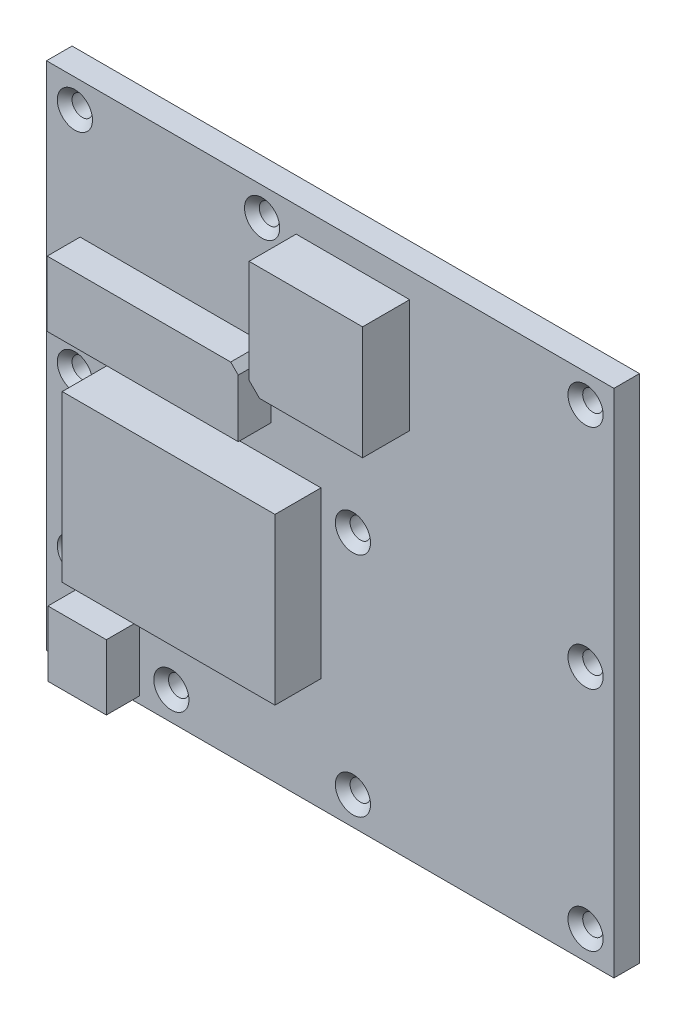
ISO-10303-21;
HEADER;
FILE_DESCRIPTION(('STEP AP214'),'2;1');
FILE_NAME('part.step','',(''),(''),'','','');
FILE_SCHEMA(('AUTOMOTIVE_DESIGN { 1 0 10303 214 1 1 1 1 }'));
ENDSEC;
DATA;
#1=APPLICATION_CONTEXT('core data for automotive mechanical design processes');
#2=APPLICATION_PROTOCOL_DEFINITION('international standard','automotive_design',2000,#1);
#3=PRODUCT_CONTEXT('',#1,'mechanical');
#4=PRODUCT('Part','Part','',(#3));
#5=PRODUCT_RELATED_PRODUCT_CATEGORY('part','',(#4));
#6=PRODUCT_DEFINITION_FORMATION('','',#4);
#7=PRODUCT_DEFINITION_CONTEXT('part definition',#1,'design');
#8=PRODUCT_DEFINITION('design','',#6,#7);
#9=PRODUCT_DEFINITION_SHAPE('','',#8);
#10=(LENGTH_UNIT() NAMED_UNIT(*) SI_UNIT(.MILLI.,.METRE.));
#11=(NAMED_UNIT(*) PLANE_ANGLE_UNIT() SI_UNIT($,.RADIAN.));
#12=(NAMED_UNIT(*) SI_UNIT($,.STERADIAN.) SOLID_ANGLE_UNIT());
#13=UNCERTAINTY_MEASURE_WITH_UNIT(LENGTH_MEASURE(1.E-05),#10,'distance_accuracy_value','');
#14=(GEOMETRIC_REPRESENTATION_CONTEXT(3) GLOBAL_UNCERTAINTY_ASSIGNED_CONTEXT((#13)) GLOBAL_UNIT_ASSIGNED_CONTEXT((#10,
#11,#12)) REPRESENTATION_CONTEXT('',''));
#15=CARTESIAN_POINT('',(0.,0.,0.));
#16=DIRECTION('',(0.,0.,1.));
#17=DIRECTION('',(1.,0.,0.));
#18=AXIS2_PLACEMENT_3D('',#15,#16,#17);
#19=CARTESIAN_POINT('',(0.,0.,4.5));
#20=DIRECTION('',(0.,0.,1.));
#21=DIRECTION('',(1.,0.,0.));
#22=AXIS2_PLACEMENT_3D('',#19,#20,#21);
#23=PLANE('',#22);
#24=CARTESIAN_POINT('',(32.0004999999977,-25.0296982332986,4.5));
#25=DIRECTION('',(0.,0.,1.));
#26=DIRECTION('',(1.,0.,0.));
#27=AXIS2_PLACEMENT_3D('',#24,#25,#26);
#28=CIRCLE('',#27,3.10000000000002);
#29=CARTESIAN_POINT('',(35.1004999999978,-25.0296982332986,4.5));
#30=VERTEX_POINT('',#29);
#31=EDGE_CURVE('E340',#30,#30,#28,.F.);
#32=ORIENTED_EDGE('',*,*,#31,.T.);
#33=EDGE_LOOP('',(#32));
#34=FACE_BOUND('',#33,.T.);
#35=CARTESIAN_POINT('',(32.0004999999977,43.0000000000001,4.5));
#36=DIRECTION('',(0.,0.,1.));
#37=DIRECTION('',(1.,0.,0.));
#38=AXIS2_PLACEMENT_3D('',#35,#36,#37);
#39=CIRCLE('',#38,3.10000000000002);
#40=CARTESIAN_POINT('',(35.1004999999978,43.0000000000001,4.5));
#41=VERTEX_POINT('',#40);
#42=EDGE_CURVE('E337',#41,#41,#39,.F.);
#43=ORIENTED_EDGE('',*,*,#42,.T.);
#44=EDGE_LOOP('',(#43));
#45=FACE_BOUND('',#44,.T.);
#46=CARTESIAN_POINT('',(64.9970974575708,43.0000000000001,4.5));
#47=DIRECTION('',(0.,0.,1.));
#48=DIRECTION('',(1.,0.,0.));
#49=AXIS2_PLACEMENT_3D('',#46,#47,#48);
#50=CIRCLE('',#49,3.10000000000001);
#51=CARTESIAN_POINT('',(68.0970974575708,43.0000000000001,4.5));
#52=VERTEX_POINT('',#51);
#53=EDGE_CURVE('E334',#52,#52,#50,.F.);
#54=ORIENTED_EDGE('',*,*,#53,.T.);
#55=EDGE_LOOP('',(#54));
#56=FACE_BOUND('',#55,.T.);
#57=CARTESIAN_POINT('',(122.000499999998,43.0000000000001,4.5));
#58=DIRECTION('',(0.,0.,1.));
#59=DIRECTION('',(1.,0.,0.));
#60=AXIS2_PLACEMENT_3D('',#57,#58,#59);
#61=CIRCLE('',#60,3.10000000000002);
#62=CARTESIAN_POINT('',(125.100499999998,43.0000000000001,4.5));
#63=VERTEX_POINT('',#62);
#64=EDGE_CURVE('E331',#63,#63,#61,.F.);
#65=ORIENTED_EDGE('',*,*,#64,.T.);
#66=EDGE_LOOP('',(#65));
#67=FACE_BOUND('',#66,.T.);
#68=CARTESIAN_POINT('',(122.000499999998,3.00000000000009,4.5));
#69=DIRECTION('',(0.,0.,1.));
#70=DIRECTION('',(1.,0.,0.));
#71=AXIS2_PLACEMENT_3D('',#68,#69,#70);
#72=CIRCLE('',#71,3.09999999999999);
#73=CARTESIAN_POINT('',(125.100499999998,3.00000000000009,4.5));
#74=VERTEX_POINT('',#73);
#75=EDGE_CURVE('E328',#74,#74,#72,.F.);
#76=ORIENTED_EDGE('',*,*,#75,.T.);
#77=EDGE_LOOP('',(#76));
#78=FACE_BOUND('',#77,.T.);
#79=CARTESIAN_POINT('',(81.0004999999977,3.00000000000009,4.5));
#80=DIRECTION('',(0.,0.,1.));
#81=DIRECTION('',(1.,0.,0.));
#82=AXIS2_PLACEMENT_3D('',#79,#80,#81);
#83=CIRCLE('',#82,3.09999999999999);
#84=CARTESIAN_POINT('',(84.1004999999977,3.00000000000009,4.5));
#85=VERTEX_POINT('',#84);
#86=EDGE_CURVE('E325',#85,#85,#83,.F.);
#87=ORIENTED_EDGE('',*,*,#86,.T.);
#88=EDGE_LOOP('',(#87));
#89=FACE_BOUND('',#88,.T.);
#90=CARTESIAN_POINT('',(122.000499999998,-36.9999999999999,4.5));
#91=DIRECTION('',(0.,0.,1.));
#92=DIRECTION('',(1.,0.,0.));
#93=AXIS2_PLACEMENT_3D('',#90,#91,#92);
#94=CIRCLE('',#93,3.10000000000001);
#95=CARTESIAN_POINT('',(125.100499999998,-36.9999999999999,4.5));
#96=VERTEX_POINT('',#95);
#97=EDGE_CURVE('E322',#96,#96,#94,.F.);
#98=ORIENTED_EDGE('',*,*,#97,.T.);
#99=EDGE_LOOP('',(#98));
#100=FACE_BOUND('',#99,.T.);
#101=CARTESIAN_POINT('',(81.0004999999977,-36.9999999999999,4.5));
#102=DIRECTION('',(0.,0.,1.));
#103=DIRECTION('',(1.,0.,0.));
#104=AXIS2_PLACEMENT_3D('',#101,#102,#103);
#105=CIRCLE('',#104,3.10000000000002);
#106=CARTESIAN_POINT('',(84.1004999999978,-36.9999999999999,4.5));
#107=VERTEX_POINT('',#106);
#108=EDGE_CURVE('E319',#107,#107,#105,.F.);
#109=ORIENTED_EDGE('',*,*,#108,.T.);
#110=EDGE_LOOP('',(#109));
#111=FACE_BOUND('',#110,.T.);
#112=CARTESIAN_POINT('',(32.0004999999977,3.00000000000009,4.5));
#113=DIRECTION('',(0.,0.,1.));
#114=DIRECTION('',(1.,0.,0.));
#115=AXIS2_PLACEMENT_3D('',#112,#113,#114);
#116=CIRCLE('',#115,3.10000000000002);
#117=CARTESIAN_POINT('',(35.1004999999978,3.00000000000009,4.5));
#118=VERTEX_POINT('',#117);
#119=EDGE_CURVE('E316',#118,#118,#116,.F.);
#120=ORIENTED_EDGE('',*,*,#119,.T.);
#121=EDGE_LOOP('',(#120));
#122=FACE_BOUND('',#121,.T.);
#123=CARTESIAN_POINT('',(49.0004999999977,-36.9999999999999,4.5));
#124=DIRECTION('',(0.,0.,1.));
#125=DIRECTION('',(1.,0.,0.));
#126=AXIS2_PLACEMENT_3D('',#123,#124,#125);
#127=CIRCLE('',#126,3.10000000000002);
#128=CARTESIAN_POINT('',(52.1004999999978,-36.9999999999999,4.5));
#129=VERTEX_POINT('',#128);
#130=EDGE_CURVE('E313',#129,#129,#127,.F.);
#131=ORIENTED_EDGE('',*,*,#130,.T.);
#132=EDGE_LOOP('',(#131));
#133=FACE_BOUND('',#132,.T.);
#134=DIRECTION('',(-1.,0.,0.));
#135=VECTOR('',#134,1.);
#136=CARTESIAN_POINT('',(32.9208999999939,24.0458017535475,4.5));
#137=LINE('',#136,#135);
#138=CARTESIAN_POINT('',(65.2575648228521,24.0458017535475,4.5));
#139=VERTEX_POINT('',#138);
#140=CARTESIAN_POINT('',(32.9208999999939,24.0458017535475,4.5));
#141=VERTEX_POINT('',#140);
#142=EDGE_CURVE('E199',#139,#141,#137,.T.);
#143=ORIENTED_EDGE('',*,*,#142,.F.);
#144=DIRECTION('',(-0.707106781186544,0.707106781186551,0.));
#145=VECTOR('',#144,1.);
#146=CARTESIAN_POINT('',(65.1070439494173,24.1963226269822,4.5));
#147=LINE('',#146,#145);
#148=CARTESIAN_POINT('',(66.5890999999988,22.7142665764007,4.5));
#149=VERTEX_POINT('',#148);
#150=EDGE_CURVE('E185',#149,#139,#147,.T.);
#151=ORIENTED_EDGE('',*,*,#150,.F.);
#152=DIRECTION('',(0.,1.,0.));
#153=VECTOR('',#152,1.);
#154=CARTESIAN_POINT('',(66.5890999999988,24.0458017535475,4.5));
#155=LINE('',#154,#153);
#156=CARTESIAN_POINT('',(66.5890999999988,12.5455825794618,4.5));
#157=VERTEX_POINT('',#156);
#158=EDGE_CURVE('E197',#157,#149,#155,.T.);
#159=ORIENTED_EDGE('',*,*,#158,.F.);
#160=DIRECTION('',(0.999999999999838,-5.69501317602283E-07,0.));
#161=VECTOR('',#160,1.);
#162=CARTESIAN_POINT('',(66.5890999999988,12.5455825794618,4.5));
#163=LINE('',#162,#161);
#164=CARTESIAN_POINT('',(32.9208999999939,12.5456017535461,4.5));
#165=VERTEX_POINT('',#164);
#166=EDGE_CURVE('E206',#165,#157,#163,.T.);
#167=ORIENTED_EDGE('',*,*,#166,.F.);
#168=DIRECTION('',(0.,-1.,0.));
#169=VECTOR('',#168,1.);
#170=CARTESIAN_POINT('',(32.9208999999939,12.5456017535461,4.5));
#171=LINE('',#170,#169);
#172=EDGE_CURVE('E210',#141,#165,#171,.T.);
#173=ORIENTED_EDGE('',*,*,#172,.F.);
#174=EDGE_LOOP('',(#143,#151,#159,#167,#173));
#175=FACE_BOUND('',#174,.T.);
#176=DIRECTION('',(1.,0.,0.));
#177=VECTOR('',#176,1.);
#178=CARTESIAN_POINT('',(70.9970974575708,23.5356686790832,4.5));
#179=LINE('',#178,#177);
#180=CARTESIAN_POINT('',(72.8387657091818,23.5356686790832,4.5));
#181=VERTEX_POINT('',#180);
#182=CARTESIAN_POINT('',(90.9970860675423,23.5356686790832,4.5));
#183=VERTEX_POINT('',#182);
#184=EDGE_CURVE('E235',#181,#183,#179,.T.);
#185=ORIENTED_EDGE('',*,*,#184,.F.);
#186=DIRECTION('',(0.707106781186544,-0.707106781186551,0.));
#187=VECTOR('',#186,1.);
#188=CARTESIAN_POINT('',(68.6425778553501,27.731856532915,4.5));
#189=LINE('',#188,#187);
#190=CARTESIAN_POINT('',(70.9970974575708,25.3773369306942,4.5));
#191=VERTEX_POINT('',#190);
#192=EDGE_CURVE('E200',#191,#181,#189,.T.);
#193=ORIENTED_EDGE('',*,*,#192,.F.);
#194=DIRECTION('',(0.,-1.,0.));
#195=VECTOR('',#194,1.);
#196=CARTESIAN_POINT('',(70.9970974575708,43.5356800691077,4.5));
#197=LINE('',#196,#195);
#198=CARTESIAN_POINT('',(70.9970974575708,43.5356800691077,4.5));
#199=VERTEX_POINT('',#198);
#200=EDGE_CURVE('E221',#199,#191,#197,.T.);
#201=ORIENTED_EDGE('',*,*,#200,.F.);
#202=DIRECTION('',(-1.,0.,0.));
#203=VECTOR('',#202,1.);
#204=CARTESIAN_POINT('',(70.9970974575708,43.5356800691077,4.5));
#205=LINE('',#204,#203);
#206=CARTESIAN_POINT('',(90.9970860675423,43.5356800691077,4.5));
#207=VERTEX_POINT('',#206);
#208=EDGE_CURVE('E226',#207,#199,#205,.T.);
#209=ORIENTED_EDGE('',*,*,#208,.F.);
#210=DIRECTION('',(0.,1.,0.));
#211=VECTOR('',#210,1.);
#212=CARTESIAN_POINT('',(90.9970860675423,43.5356800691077,4.5));
#213=LINE('',#212,#211);
#214=EDGE_CURVE('E237',#183,#207,#213,.T.);
#215=ORIENTED_EDGE('',*,*,#214,.F.);
#216=EDGE_LOOP('',(#185,#193,#201,#209,#215));
#217=FACE_BOUND('',#216,.T.);
#218=DIRECTION('',(1.,0.,0.));
#219=VECTOR('',#218,1.);
#220=CARTESIAN_POINT('',(127.000499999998,-41.9999999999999,4.5));
#221=LINE('',#220,#219);
#222=CARTESIAN_POINT('',(27.0004999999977,-41.9999999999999,4.5));
#223=VERTEX_POINT('',#222);
#224=CARTESIAN_POINT('',(127.000499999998,-41.9999999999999,4.5));
#225=VERTEX_POINT('',#224);
#226=EDGE_CURVE('E278',#223,#225,#221,.T.);
#227=ORIENTED_EDGE('',*,*,#226,.T.);
#228=DIRECTION('',(0.,1.,0.));
#229=VECTOR('',#228,1.);
#230=CARTESIAN_POINT('',(127.000499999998,48.0000000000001,4.5));
#231=LINE('',#230,#229);
#232=CARTESIAN_POINT('',(127.000499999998,48.0000000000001,4.5));
#233=VERTEX_POINT('',#232);
#234=EDGE_CURVE('E281',#225,#233,#231,.T.);
#235=ORIENTED_EDGE('',*,*,#234,.T.);
#236=DIRECTION('',(-1.,0.,0.));
#237=VECTOR('',#236,1.);
#238=CARTESIAN_POINT('',(27.0004999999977,48.0000000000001,4.5));
#239=LINE('',#238,#237);
#240=CARTESIAN_POINT('',(27.0004999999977,48.0000000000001,4.5));
#241=VERTEX_POINT('',#240);
#242=EDGE_CURVE('E284',#233,#241,#239,.T.);
#243=ORIENTED_EDGE('',*,*,#242,.T.);
#244=DIRECTION('',(0.,-1.,0.));
#245=VECTOR('',#244,1.);
#246=CARTESIAN_POINT('',(27.0004999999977,48.0000000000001,4.5));
#247=LINE('',#246,#245);
#248=EDGE_CURVE('E286',#241,#223,#247,.T.);
#249=ORIENTED_EDGE('',*,*,#248,.T.);
#250=EDGE_LOOP('',(#227,#235,#243,#249));
#251=FACE_BOUND('',#250,.T.);
#252=DIRECTION('',(1.,0.,0.));
#253=VECTOR('',#252,1.);
#254=CARTESIAN_POINT('',(37.8630766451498,-22.1302010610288,4.5));
#255=LINE('',#254,#253);
#256=CARTESIAN_POINT('',(37.8630766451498,-22.1302010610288,4.5));
#257=VERTEX_POINT('',#256);
#258=CARTESIAN_POINT('',(75.3630600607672,-22.1302010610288,4.5));
#259=VERTEX_POINT('',#258);
#260=EDGE_CURVE('E262',#257,#259,#255,.T.);
#261=ORIENTED_EDGE('',*,*,#260,.F.);
#262=DIRECTION('',(0.,-1.,0.));
#263=VECTOR('',#262,1.);
#264=CARTESIAN_POINT('',(37.8630766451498,6.99069893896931,4.5));
#265=LINE('',#264,#263);
#266=CARTESIAN_POINT('',(37.8630766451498,6.99069893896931,4.5));
#267=VERTEX_POINT('',#266);
#268=EDGE_CURVE('E248',#267,#257,#265,.T.);
#269=ORIENTED_EDGE('',*,*,#268,.F.);
#270=DIRECTION('',(-1.,0.,0.));
#271=VECTOR('',#270,1.);
#272=CARTESIAN_POINT('',(37.8630766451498,6.99069893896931,4.5));
#273=LINE('',#272,#271);
#274=CARTESIAN_POINT('',(75.3630600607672,6.99069893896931,4.5));
#275=VERTEX_POINT('',#274);
#276=EDGE_CURVE('E253',#275,#267,#273,.T.);
#277=ORIENTED_EDGE('',*,*,#276,.F.);
#278=DIRECTION('',(0.,1.,0.));
#279=VECTOR('',#278,1.);
#280=CARTESIAN_POINT('',(75.3630600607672,6.99069893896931,4.5));
#281=LINE('',#280,#279);
#282=EDGE_CURVE('E264',#259,#275,#281,.T.);
#283=ORIENTED_EDGE('',*,*,#282,.F.);
#284=EDGE_LOOP('',(#261,#269,#277,#283));
#285=FACE_BOUND('',#284,.T.);
#286=DIRECTION('',(1.,0.,0.));
#287=VECTOR('',#286,1.);
#288=CARTESIAN_POINT('',(43.3481000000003,-40.7944000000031,4.5));
#289=LINE('',#288,#287);
#290=CARTESIAN_POINT('',(33.0478999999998,-40.7944000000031,4.5));
#291=VERTEX_POINT('',#290);
#292=CARTESIAN_POINT('',(43.3481000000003,-40.7944000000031,4.5));
#293=VERTEX_POINT('',#292);
#294=EDGE_CURVE('E501',#291,#293,#289,.T.);
#295=ORIENTED_EDGE('',*,*,#294,.F.);
#296=DIRECTION('',(0.,-1.,0.));
#297=VECTOR('',#296,1.);
#298=CARTESIAN_POINT('',(33.0478999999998,-40.7944000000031,4.5));
#299=LINE('',#298,#297);
#300=CARTESIAN_POINT('',(33.0478999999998,-29.2941985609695,4.5));
#301=VERTEX_POINT('',#300);
#302=EDGE_CURVE('E487',#301,#291,#299,.T.);
#303=ORIENTED_EDGE('',*,*,#302,.F.);
#304=DIRECTION('',(-1.,0.,0.));
#305=VECTOR('',#304,1.);
#306=CARTESIAN_POINT('',(33.0478999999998,-29.2941985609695,4.5));
#307=LINE('',#306,#305);
#308=CARTESIAN_POINT('',(43.3481000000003,-29.2941985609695,4.5));
#309=VERTEX_POINT('',#308);
#310=EDGE_CURVE('E492',#309,#301,#307,.T.);
#311=ORIENTED_EDGE('',*,*,#310,.F.);
#312=DIRECTION('',(0.,1.,0.));
#313=VECTOR('',#312,1.);
#314=CARTESIAN_POINT('',(43.3481000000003,-29.2941985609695,4.5));
#315=LINE('',#314,#313);
#316=EDGE_CURVE('E503',#293,#309,#315,.T.);
#317=ORIENTED_EDGE('',*,*,#316,.F.);
#318=EDGE_LOOP('',(#295,#303,#311,#317));
#319=FACE_BOUND('',#318,.T.);
#320=ADVANCED_FACE('F35',(#34,#45,#56,#67,#78,#89,#100,#111,#122,#133,#175,#217,#251,#285,#319),
#23,.T.);
#321=CARTESIAN_POINT('',(127.000499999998,-41.9999999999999,4.5));
#322=DIRECTION('',(0.,1.,0.));
#323=DIRECTION('',(-1.,0.,0.));
#324=AXIS2_PLACEMENT_3D('',#321,#322,#323);
#325=PLANE('',#324);
#326=DIRECTION('',(1.,0.,0.));
#327=VECTOR('',#326,1.);
#328=CARTESIAN_POINT('',(127.000499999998,-41.9999999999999,0.));
#329=LINE('',#328,#327);
#330=CARTESIAN_POINT('',(27.0004999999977,-41.9999999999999,0.));
#331=VERTEX_POINT('',#330);
#332=CARTESIAN_POINT('',(127.000499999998,-41.9999999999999,0.));
#333=VERTEX_POINT('',#332);
#334=EDGE_CURVE('E277',#331,#333,#329,.T.);
#335=ORIENTED_EDGE('',*,*,#334,.T.);
#336=DIRECTION('',(0.,0.,-1.));
#337=VECTOR('',#336,1.);
#338=CARTESIAN_POINT('',(127.000499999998,-41.9999999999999,4.5));
#339=LINE('',#338,#337);
#340=EDGE_CURVE('E304',#225,#333,#339,.T.);
#341=ORIENTED_EDGE('',*,*,#340,.F.);
#342=ORIENTED_EDGE('',*,*,#226,.F.);
#343=DIRECTION('',(0.,0.,-1.));
#344=VECTOR('',#343,1.);
#345=CARTESIAN_POINT('',(27.0004999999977,-41.9999999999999,4.5));
#346=LINE('',#345,#344);
#347=EDGE_CURVE('E288',#223,#331,#346,.T.);
#348=ORIENTED_EDGE('',*,*,#347,.T.);
#349=EDGE_LOOP('',(#335,#341,#342,#348));
#350=FACE_BOUND('',#349,.T.);
#351=ADVANCED_FACE('F383',(#350),#325,.F.);
#352=CARTESIAN_POINT('',(127.000499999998,48.0000000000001,4.5));
#353=DIRECTION('',(-1.,0.,0.));
#354=DIRECTION('',(0.,0.,1.));
#355=AXIS2_PLACEMENT_3D('',#352,#353,#354);
#356=PLANE('',#355);
#357=DIRECTION('',(0.,1.,0.));
#358=VECTOR('',#357,1.);
#359=CARTESIAN_POINT('',(127.000499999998,48.0000000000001,0.));
#360=LINE('',#359,#358);
#361=CARTESIAN_POINT('',(127.000499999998,48.0000000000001,0.));
#362=VERTEX_POINT('',#361);
#363=EDGE_CURVE('E291',#333,#362,#360,.T.);
#364=ORIENTED_EDGE('',*,*,#363,.T.);
#365=DIRECTION('',(0.,0.,-1.));
#366=VECTOR('',#365,1.);
#367=CARTESIAN_POINT('',(127.000499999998,48.0000000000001,4.5));
#368=LINE('',#367,#366);
#369=EDGE_CURVE('E301',#233,#362,#368,.T.);
#370=ORIENTED_EDGE('',*,*,#369,.F.);
#371=ORIENTED_EDGE('',*,*,#234,.F.);
#372=ORIENTED_EDGE('',*,*,#340,.T.);
#373=EDGE_LOOP('',(#364,#370,#371,#372));
#374=FACE_BOUND('',#373,.T.);
#375=ADVANCED_FACE('F389',(#374),#356,.F.);
#376=CARTESIAN_POINT('',(27.0004999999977,48.0000000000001,4.5));
#377=DIRECTION('',(0.,-1.,0.));
#378=DIRECTION('',(0.,0.,-1.));
#379=AXIS2_PLACEMENT_3D('',#376,#377,#378);
#380=PLANE('',#379);
#381=DIRECTION('',(-1.,0.,0.));
#382=VECTOR('',#381,1.);
#383=CARTESIAN_POINT('',(27.0004999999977,48.0000000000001,0.));
#384=LINE('',#383,#382);
#385=CARTESIAN_POINT('',(27.0004999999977,48.0000000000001,0.));
#386=VERTEX_POINT('',#385);
#387=EDGE_CURVE('E293',#362,#386,#384,.T.);
#388=ORIENTED_EDGE('',*,*,#387,.T.);
#389=DIRECTION('',(0.,0.,-1.));
#390=VECTOR('',#389,1.);
#391=CARTESIAN_POINT('',(27.0004999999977,48.0000000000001,4.5));
#392=LINE('',#391,#390);
#393=EDGE_CURVE('E298',#241,#386,#392,.T.);
#394=ORIENTED_EDGE('',*,*,#393,.F.);
#395=ORIENTED_EDGE('',*,*,#242,.F.);
#396=ORIENTED_EDGE('',*,*,#369,.T.);
#397=EDGE_LOOP('',(#388,#394,#395,#396));
#398=FACE_BOUND('',#397,.T.);
#399=ADVANCED_FACE('F404',(#398),#380,.F.);
#400=CARTESIAN_POINT('',(27.0004999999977,48.0000000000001,4.5));
#401=DIRECTION('',(1.,0.,0.));
#402=DIRECTION('',(0.,1.,0.));
#403=AXIS2_PLACEMENT_3D('',#400,#401,#402);
#404=PLANE('',#403);
#405=DIRECTION('',(0.,-1.,0.));
#406=VECTOR('',#405,1.);
#407=CARTESIAN_POINT('',(27.0004999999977,48.0000000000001,0.));
#408=LINE('',#407,#406);
#409=EDGE_CURVE('E282',#386,#331,#408,.T.);
#410=ORIENTED_EDGE('',*,*,#409,.T.);
#411=ORIENTED_EDGE('',*,*,#347,.F.);
#412=ORIENTED_EDGE('',*,*,#248,.F.);
#413=ORIENTED_EDGE('',*,*,#393,.T.);
#414=EDGE_LOOP('',(#410,#411,#412,#413));
#415=FACE_BOUND('',#414,.T.);
#416=ADVANCED_FACE('F400',(#415),#404,.F.);
#417=CARTESIAN_POINT('',(0.,0.,0.));
#418=DIRECTION('',(0.,0.,1.));
#419=DIRECTION('',(1.,0.,0.));
#420=AXIS2_PLACEMENT_3D('',#417,#418,#419);
#421=PLANE('',#420);
#422=CARTESIAN_POINT('',(81.0004999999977,3.00000000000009,0.));
#423=DIRECTION('',(0.,0.,1.));
#424=DIRECTION('',(1.,0.,0.));
#425=AXIS2_PLACEMENT_3D('',#422,#423,#424);
#426=CIRCLE('',#425,1.79999999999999);
#427=CARTESIAN_POINT('',(82.8004999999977,3.00000000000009,0.));
#428=VERTEX_POINT('',#427);
#429=EDGE_CURVE('E459',#428,#428,#426,.T.);
#430=ORIENTED_EDGE('',*,*,#429,.T.);
#431=EDGE_LOOP('',(#430));
#432=FACE_BOUND('',#431,.T.);
#433=CARTESIAN_POINT('',(122.000499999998,3.00000000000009,0.));
#434=DIRECTION('',(0.,0.,1.));
#435=DIRECTION('',(1.,0.,0.));
#436=AXIS2_PLACEMENT_3D('',#433,#434,#435);
#437=CIRCLE('',#436,1.79999999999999);
#438=CARTESIAN_POINT('',(123.800499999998,3.00000000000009,0.));
#439=VERTEX_POINT('',#438);
#440=EDGE_CURVE('E455',#439,#439,#437,.T.);
#441=ORIENTED_EDGE('',*,*,#440,.T.);
#442=EDGE_LOOP('',(#441));
#443=FACE_BOUND('',#442,.T.);
#444=CARTESIAN_POINT('',(122.000499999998,-36.9999999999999,0.));
#445=DIRECTION('',(0.,0.,1.));
#446=DIRECTION('',(1.,0.,0.));
#447=AXIS2_PLACEMENT_3D('',#444,#445,#446);
#448=CIRCLE('',#447,1.79999999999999);
#449=CARTESIAN_POINT('',(123.800499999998,-36.9999999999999,0.));
#450=VERTEX_POINT('',#449);
#451=EDGE_CURVE('E453',#450,#450,#448,.T.);
#452=ORIENTED_EDGE('',*,*,#451,.T.);
#453=EDGE_LOOP('',(#452));
#454=FACE_BOUND('',#453,.T.);
#455=CARTESIAN_POINT('',(49.0004999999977,-36.9999999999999,0.));
#456=DIRECTION('',(0.,0.,1.));
#457=DIRECTION('',(1.,0.,0.));
#458=AXIS2_PLACEMENT_3D('',#455,#456,#457);
#459=CIRCLE('',#458,1.8);
#460=CARTESIAN_POINT('',(50.8004999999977,-36.9999999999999,0.));
#461=VERTEX_POINT('',#460);
#462=EDGE_CURVE('E456',#461,#461,#459,.T.);
#463=ORIENTED_EDGE('',*,*,#462,.T.);
#464=EDGE_LOOP('',(#463));
#465=FACE_BOUND('',#464,.T.);
#466=CARTESIAN_POINT('',(32.0004999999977,3.00000000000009,0.));
#467=DIRECTION('',(0.,0.,1.));
#468=DIRECTION('',(1.,0.,0.));
#469=AXIS2_PLACEMENT_3D('',#466,#467,#468);
#470=CIRCLE('',#469,1.8);
#471=CARTESIAN_POINT('',(33.8004999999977,3.00000000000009,0.));
#472=VERTEX_POINT('',#471);
#473=EDGE_CURVE('E462',#472,#472,#470,.T.);
#474=ORIENTED_EDGE('',*,*,#473,.T.);
#475=EDGE_LOOP('',(#474));
#476=FACE_BOUND('',#475,.T.);
#477=CARTESIAN_POINT('',(32.0004999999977,-25.0296982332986,0.));
#478=DIRECTION('',(0.,0.,1.));
#479=DIRECTION('',(1.,0.,0.));
#480=AXIS2_PLACEMENT_3D('',#477,#478,#479);
#481=CIRCLE('',#480,1.8);
#482=CARTESIAN_POINT('',(33.8004999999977,-25.0296982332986,0.));
#483=VERTEX_POINT('',#482);
#484=EDGE_CURVE('E471',#483,#483,#481,.T.);
#485=ORIENTED_EDGE('',*,*,#484,.T.);
#486=EDGE_LOOP('',(#485));
#487=FACE_BOUND('',#486,.T.);
#488=CARTESIAN_POINT('',(32.0004999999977,43.0000000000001,0.));
#489=DIRECTION('',(0.,0.,1.));
#490=DIRECTION('',(1.,0.,0.));
#491=AXIS2_PLACEMENT_3D('',#488,#489,#490);
#492=CIRCLE('',#491,1.8);
#493=CARTESIAN_POINT('',(33.8004999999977,43.0000000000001,0.));
#494=VERTEX_POINT('',#493);
#495=EDGE_CURVE('E480',#494,#494,#492,.T.);
#496=ORIENTED_EDGE('',*,*,#495,.T.);
#497=EDGE_LOOP('',(#496));
#498=FACE_BOUND('',#497,.T.);
#499=CARTESIAN_POINT('',(64.9970974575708,43.0000000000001,0.));
#500=DIRECTION('',(0.,0.,1.));
#501=DIRECTION('',(1.,0.,0.));
#502=AXIS2_PLACEMENT_3D('',#499,#500,#501);
#503=CIRCLE('',#502,1.79999999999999);
#504=CARTESIAN_POINT('',(66.7970974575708,43.0000000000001,0.));
#505=VERTEX_POINT('',#504);
#506=EDGE_CURVE('E477',#505,#505,#503,.T.);
#507=ORIENTED_EDGE('',*,*,#506,.T.);
#508=EDGE_LOOP('',(#507));
#509=FACE_BOUND('',#508,.T.);
#510=CARTESIAN_POINT('',(81.0004999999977,-36.9999999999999,0.));
#511=DIRECTION('',(0.,0.,1.));
#512=DIRECTION('',(1.,0.,0.));
#513=AXIS2_PLACEMENT_3D('',#510,#511,#512);
#514=CIRCLE('',#513,1.79999999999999);
#515=CARTESIAN_POINT('',(82.8004999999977,-36.9999999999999,0.));
#516=VERTEX_POINT('',#515);
#517=EDGE_CURVE('E473',#516,#516,#514,.T.);
#518=ORIENTED_EDGE('',*,*,#517,.T.);
#519=EDGE_LOOP('',(#518));
#520=FACE_BOUND('',#519,.T.);
#521=CARTESIAN_POINT('',(122.000499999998,43.0000000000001,0.));
#522=DIRECTION('',(0.,0.,1.));
#523=DIRECTION('',(1.,0.,0.));
#524=AXIS2_PLACEMENT_3D('',#521,#522,#523);
#525=CIRCLE('',#524,1.79999999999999);
#526=CARTESIAN_POINT('',(123.800499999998,43.0000000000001,0.));
#527=VERTEX_POINT('',#526);
#528=EDGE_CURVE('E476',#527,#527,#525,.T.);
#529=ORIENTED_EDGE('',*,*,#528,.T.);
#530=EDGE_LOOP('',(#529));
#531=FACE_BOUND('',#530,.T.);
#532=ORIENTED_EDGE('',*,*,#334,.F.);
#533=ORIENTED_EDGE('',*,*,#409,.F.);
#534=ORIENTED_EDGE('',*,*,#387,.F.);
#535=ORIENTED_EDGE('',*,*,#363,.F.);
#536=EDGE_LOOP('',(#532,#533,#534,#535));
#537=FACE_BOUND('',#536,.T.);
#538=ADVANCED_FACE('F397',(#432,#443,#454,#465,#476,#487,#498,#509,#520,#531,#537),#421,.F.);
#539=CARTESIAN_POINT('',(37.8630766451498,6.99069893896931,12.6));
#540=DIRECTION('',(1.,0.,0.));
#541=DIRECTION('',(0.,1.,0.));
#542=AXIS2_PLACEMENT_3D('',#539,#540,#541);
#543=PLANE('',#542);
#544=ORIENTED_EDGE('',*,*,#268,.T.);
#545=DIRECTION('',(0.,0.,-1.));
#546=VECTOR('',#545,1.);
#547=CARTESIAN_POINT('',(37.8630766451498,-22.1302010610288,12.6));
#548=LINE('',#547,#546);
#549=CARTESIAN_POINT('',(37.8630766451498,-22.1302010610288,12.6));
#550=VERTEX_POINT('',#549);
#551=EDGE_CURVE('E275',#550,#257,#548,.T.);
#552=ORIENTED_EDGE('',*,*,#551,.F.);
#553=DIRECTION('',(0.,-1.,0.));
#554=VECTOR('',#553,1.);
#555=CARTESIAN_POINT('',(37.8630766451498,6.99069893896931,12.6));
#556=LINE('',#555,#554);
#557=CARTESIAN_POINT('',(37.8630766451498,6.99069893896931,12.6));
#558=VERTEX_POINT('',#557);
#559=EDGE_CURVE('E249',#558,#550,#556,.T.);
#560=ORIENTED_EDGE('',*,*,#559,.F.);
#561=DIRECTION('',(0.,0.,-1.));
#562=VECTOR('',#561,1.);
#563=CARTESIAN_POINT('',(37.8630766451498,6.99069893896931,12.6));
#564=LINE('',#563,#562);
#565=EDGE_CURVE('E259',#558,#267,#564,.T.);
#566=ORIENTED_EDGE('',*,*,#565,.T.);
#567=EDGE_LOOP('',(#544,#552,#560,#566));
#568=FACE_BOUND('',#567,.T.);
#569=ADVANCED_FACE('F395',(#568),#543,.F.);
#570=CARTESIAN_POINT('',(37.8630766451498,-22.1302010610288,12.6));
#571=DIRECTION('',(0.,1.,0.));
#572=DIRECTION('',(0.,0.,1.));
#573=AXIS2_PLACEMENT_3D('',#570,#571,#572);
#574=PLANE('',#573);
#575=ORIENTED_EDGE('',*,*,#260,.T.);
#576=DIRECTION('',(0.,0.,-1.));
#577=VECTOR('',#576,1.);
#578=CARTESIAN_POINT('',(75.3630600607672,-22.1302010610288,12.6));
#579=LINE('',#578,#577);
#580=CARTESIAN_POINT('',(75.3630600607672,-22.1302010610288,12.6));
#581=VERTEX_POINT('',#580);
#582=EDGE_CURVE('E272',#581,#259,#579,.T.);
#583=ORIENTED_EDGE('',*,*,#582,.F.);
#584=DIRECTION('',(1.,0.,0.));
#585=VECTOR('',#584,1.);
#586=CARTESIAN_POINT('',(37.8630766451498,-22.1302010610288,12.6));
#587=LINE('',#586,#585);
#588=EDGE_CURVE('E252',#550,#581,#587,.T.);
#589=ORIENTED_EDGE('',*,*,#588,.F.);
#590=ORIENTED_EDGE('',*,*,#551,.T.);
#591=EDGE_LOOP('',(#575,#583,#589,#590));
#592=FACE_BOUND('',#591,.T.);
#593=ADVANCED_FACE('F649',(#592),#574,.F.);
#594=CARTESIAN_POINT('',(75.3630600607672,6.99069893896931,12.6));
#595=DIRECTION('',(-1.,0.,0.));
#596=DIRECTION('',(0.,0.,1.));
#597=AXIS2_PLACEMENT_3D('',#594,#595,#596);
#598=PLANE('',#597);
#599=ORIENTED_EDGE('',*,*,#282,.T.);
#600=DIRECTION('',(0.,0.,-1.));
#601=VECTOR('',#600,1.);
#602=CARTESIAN_POINT('',(75.3630600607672,6.99069893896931,12.6));
#603=LINE('',#602,#601);
#604=CARTESIAN_POINT('',(75.3630600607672,6.99069893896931,12.6));
#605=VERTEX_POINT('',#604);
#606=EDGE_CURVE('E270',#605,#275,#603,.T.);
#607=ORIENTED_EDGE('',*,*,#606,.F.);
#608=DIRECTION('',(0.,1.,0.));
#609=VECTOR('',#608,1.);
#610=CARTESIAN_POINT('',(75.3630600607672,6.99069893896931,12.6));
#611=LINE('',#610,#609);
#612=EDGE_CURVE('E255',#581,#605,#611,.T.);
#613=ORIENTED_EDGE('',*,*,#612,.F.);
#614=ORIENTED_EDGE('',*,*,#582,.T.);
#615=EDGE_LOOP('',(#599,#607,#613,#614));
#616=FACE_BOUND('',#615,.T.);
#617=ADVANCED_FACE('F646',(#616),#598,.F.);
#618=CARTESIAN_POINT('',(37.8630766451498,6.99069893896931,12.6));
#619=DIRECTION('',(0.,-1.,0.));
#620=DIRECTION('',(0.,0.,-1.));
#621=AXIS2_PLACEMENT_3D('',#618,#619,#620);
#622=PLANE('',#621);
#623=ORIENTED_EDGE('',*,*,#276,.T.);
#624=ORIENTED_EDGE('',*,*,#565,.F.);
#625=DIRECTION('',(-1.,0.,0.));
#626=VECTOR('',#625,1.);
#627=CARTESIAN_POINT('',(37.8630766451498,6.99069893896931,12.6));
#628=LINE('',#627,#626);
#629=EDGE_CURVE('E257',#605,#558,#628,.T.);
#630=ORIENTED_EDGE('',*,*,#629,.F.);
#631=ORIENTED_EDGE('',*,*,#606,.T.);
#632=EDGE_LOOP('',(#623,#624,#630,#631));
#633=FACE_BOUND('',#632,.T.);
#634=ADVANCED_FACE('F642',(#633),#622,.F.);
#635=CARTESIAN_POINT('',(0.,0.,12.6));
#636=DIRECTION('',(0.,0.,1.));
#637=DIRECTION('',(1.,0.,0.));
#638=AXIS2_PLACEMENT_3D('',#635,#636,#637);
#639=PLANE('',#638);
#640=ORIENTED_EDGE('',*,*,#559,.T.);
#641=ORIENTED_EDGE('',*,*,#588,.T.);
#642=ORIENTED_EDGE('',*,*,#612,.T.);
#643=ORIENTED_EDGE('',*,*,#629,.T.);
#644=EDGE_LOOP('',(#640,#641,#642,#643));
#645=FACE_BOUND('',#644,.T.);
#646=ADVANCED_FACE('F639',(#645),#639,.T.);
#647=CARTESIAN_POINT('',(70.9970974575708,43.5356800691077,12.8));
#648=DIRECTION('',(1.,0.,0.));
#649=DIRECTION('',(0.,0.,-1.));
#650=AXIS2_PLACEMENT_3D('',#647,#648,#649);
#651=PLANE('',#650);
#652=ORIENTED_EDGE('',*,*,#200,.T.);
#653=DIRECTION('',(0.,0.,1.));
#654=VECTOR('',#653,1.);
#655=CARTESIAN_POINT('',(70.9970974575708,25.3773369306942,12.8));
#656=LINE('',#655,#654);
#657=CARTESIAN_POINT('',(70.9970974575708,25.3773369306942,12.8));
#658=VERTEX_POINT('',#657);
#659=EDGE_CURVE('E465',#191,#658,#656,.T.);
#660=ORIENTED_EDGE('',*,*,#659,.T.);
#661=DIRECTION('',(0.,-1.,0.));
#662=VECTOR('',#661,1.);
#663=CARTESIAN_POINT('',(70.9970974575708,43.5356800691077,12.8));
#664=LINE('',#663,#662);
#665=CARTESIAN_POINT('',(70.9970974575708,43.5356800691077,12.8));
#666=VERTEX_POINT('',#665);
#667=EDGE_CURVE('E222',#666,#658,#664,.T.);
#668=ORIENTED_EDGE('',*,*,#667,.F.);
#669=DIRECTION('',(0.,0.,-1.));
#670=VECTOR('',#669,1.);
#671=CARTESIAN_POINT('',(70.9970974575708,43.5356800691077,12.8));
#672=LINE('',#671,#670);
#673=EDGE_CURVE('E232',#666,#199,#672,.T.);
#674=ORIENTED_EDGE('',*,*,#673,.T.);
#675=EDGE_LOOP('',(#652,#660,#668,#674));
#676=FACE_BOUND('',#675,.T.);
#677=ADVANCED_FACE('F543',(#676),#651,.F.);
#678=CARTESIAN_POINT('',(70.9970974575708,23.5356686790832,12.8));
#679=DIRECTION('',(0.,1.,0.));
#680=DIRECTION('',(0.,0.,1.));
#681=AXIS2_PLACEMENT_3D('',#678,#679,#680);
#682=PLANE('',#681);
#683=DIRECTION('',(1.,0.,0.));
#684=VECTOR('',#683,1.);
#685=CARTESIAN_POINT('',(70.9970974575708,23.5356686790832,12.8));
#686=LINE('',#685,#684);
#687=CARTESIAN_POINT('',(72.8387657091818,23.5356686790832,12.8));
#688=VERTEX_POINT('',#687);
#689=CARTESIAN_POINT('',(90.9970860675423,23.5356686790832,12.8));
#690=VERTEX_POINT('',#689);
#691=EDGE_CURVE('E225',#688,#690,#686,.T.);
#692=ORIENTED_EDGE('',*,*,#691,.F.);
#693=DIRECTION('',(0.,0.,-1.));
#694=VECTOR('',#693,1.);
#695=CARTESIAN_POINT('',(72.8387657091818,23.5356686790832,12.8));
#696=LINE('',#695,#694);
#697=EDGE_CURVE('E50',#688,#181,#696,.T.);
#698=ORIENTED_EDGE('',*,*,#697,.T.);
#699=ORIENTED_EDGE('',*,*,#184,.T.);
#700=DIRECTION('',(0.,0.,-1.));
#701=VECTOR('',#700,1.);
#702=CARTESIAN_POINT('',(90.9970860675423,23.5356686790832,12.8));
#703=LINE('',#702,#701);
#704=EDGE_CURVE('E245',#690,#183,#703,.T.);
#705=ORIENTED_EDGE('',*,*,#704,.F.);
#706=EDGE_LOOP('',(#692,#698,#699,#705));
#707=FACE_BOUND('',#706,.T.);
#708=ADVANCED_FACE('F633',(#707),#682,.F.);
#709=CARTESIAN_POINT('',(90.9970860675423,43.5356800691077,12.8));
#710=DIRECTION('',(-1.,0.,0.));
#711=DIRECTION('',(0.,0.,1.));
#712=AXIS2_PLACEMENT_3D('',#709,#710,#711);
#713=PLANE('',#712);
#714=ORIENTED_EDGE('',*,*,#214,.T.);
#715=DIRECTION('',(0.,0.,-1.));
#716=VECTOR('',#715,1.);
#717=CARTESIAN_POINT('',(90.9970860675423,43.5356800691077,12.8));
#718=LINE('',#717,#716);
#719=CARTESIAN_POINT('',(90.9970860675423,43.5356800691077,12.8));
#720=VERTEX_POINT('',#719);
#721=EDGE_CURVE('E243',#720,#207,#718,.T.);
#722=ORIENTED_EDGE('',*,*,#721,.F.);
#723=DIRECTION('',(0.,1.,0.));
#724=VECTOR('',#723,1.);
#725=CARTESIAN_POINT('',(90.9970860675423,43.5356800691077,12.8));
#726=LINE('',#725,#724);
#727=EDGE_CURVE('E228',#690,#720,#726,.T.);
#728=ORIENTED_EDGE('',*,*,#727,.F.);
#729=ORIENTED_EDGE('',*,*,#704,.T.);
#730=EDGE_LOOP('',(#714,#722,#728,#729));
#731=FACE_BOUND('',#730,.T.);
#732=ADVANCED_FACE('F630',(#731),#713,.F.);
#733=CARTESIAN_POINT('',(70.9970974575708,43.5356800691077,12.8));
#734=DIRECTION('',(0.,-1.,0.));
#735=DIRECTION('',(0.,0.,-1.));
#736=AXIS2_PLACEMENT_3D('',#733,#734,#735);
#737=PLANE('',#736);
#738=ORIENTED_EDGE('',*,*,#208,.T.);
#739=ORIENTED_EDGE('',*,*,#673,.F.);
#740=DIRECTION('',(-1.,0.,0.));
#741=VECTOR('',#740,1.);
#742=CARTESIAN_POINT('',(70.9970974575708,43.5356800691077,12.8));
#743=LINE('',#742,#741);
#744=EDGE_CURVE('E230',#720,#666,#743,.T.);
#745=ORIENTED_EDGE('',*,*,#744,.F.);
#746=ORIENTED_EDGE('',*,*,#721,.T.);
#747=EDGE_LOOP('',(#738,#739,#745,#746));
#748=FACE_BOUND('',#747,.T.);
#749=ADVANCED_FACE('F553',(#748),#737,.F.);
#750=CARTESIAN_POINT('',(0.,0.,12.8));
#751=DIRECTION('',(0.,0.,1.));
#752=DIRECTION('',(1.,0.,0.));
#753=AXIS2_PLACEMENT_3D('',#750,#751,#752);
#754=PLANE('',#753);
#755=DIRECTION('',(-0.707106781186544,0.707106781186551,0.));
#756=VECTOR('',#755,1.);
#757=CARTESIAN_POINT('',(48.1872171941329,48.1872171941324,12.8));
#758=LINE('',#757,#756);
#759=EDGE_CURVE('E308',#688,#658,#758,.T.);
#760=ORIENTED_EDGE('',*,*,#759,.F.);
#761=ORIENTED_EDGE('',*,*,#691,.T.);
#762=ORIENTED_EDGE('',*,*,#727,.T.);
#763=ORIENTED_EDGE('',*,*,#744,.T.);
#764=ORIENTED_EDGE('',*,*,#667,.T.);
#765=EDGE_LOOP('',(#760,#761,#762,#763,#764));
#766=FACE_BOUND('',#765,.T.);
#767=ADVANCED_FACE('F547',(#766),#754,.T.);
#768=CARTESIAN_POINT('',(32.9208999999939,12.5456017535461,10.3));
#769=DIRECTION('',(1.,0.,0.));
#770=DIRECTION('',(0.,0.,-1.));
#771=AXIS2_PLACEMENT_3D('',#768,#769,#770);
#772=PLANE('',#771);
#773=ORIENTED_EDGE('',*,*,#172,.T.);
#774=DIRECTION('',(0.,0.,-1.));
#775=VECTOR('',#774,1.);
#776=CARTESIAN_POINT('',(32.9208999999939,12.5456017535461,10.3));
#777=LINE('',#776,#775);
#778=CARTESIAN_POINT('',(32.9208999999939,12.5456017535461,10.3));
#779=VERTEX_POINT('',#778);
#780=EDGE_CURVE('E219',#779,#165,#777,.T.);
#781=ORIENTED_EDGE('',*,*,#780,.F.);
#782=DIRECTION('',(0.,-1.,0.));
#783=VECTOR('',#782,1.);
#784=CARTESIAN_POINT('',(32.9208999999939,12.5456017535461,10.3));
#785=LINE('',#784,#783);
#786=CARTESIAN_POINT('',(32.9208999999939,24.0458017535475,10.3));
#787=VERTEX_POINT('',#786);
#788=EDGE_CURVE('E208',#787,#779,#785,.T.);
#789=ORIENTED_EDGE('',*,*,#788,.F.);
#790=DIRECTION('',(0.,0.,-1.));
#791=VECTOR('',#790,1.);
#792=CARTESIAN_POINT('',(32.9208999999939,24.0458017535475,10.3));
#793=LINE('',#792,#791);
#794=EDGE_CURVE('E214',#787,#141,#793,.T.);
#795=ORIENTED_EDGE('',*,*,#794,.T.);
#796=EDGE_LOOP('',(#773,#781,#789,#795));
#797=FACE_BOUND('',#796,.T.);
#798=ADVANCED_FACE('F525',(#797),#772,.F.);
#799=CARTESIAN_POINT('',(66.5890999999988,12.5455825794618,10.3));
#800=DIRECTION('',(5.69501317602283E-07,0.999999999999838,0.));
#801=DIRECTION('',(-0.999999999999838,5.69501317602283E-07,0.));
#802=AXIS2_PLACEMENT_3D('',#799,#800,#801);
#803=PLANE('',#802);
#804=ORIENTED_EDGE('',*,*,#166,.T.);
#805=DIRECTION('',(0.,0.,-1.));
#806=VECTOR('',#805,1.);
#807=CARTESIAN_POINT('',(66.5890999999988,12.5455825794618,10.3));
#808=LINE('',#807,#806);
#809=CARTESIAN_POINT('',(66.5890999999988,12.5455825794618,10.3));
#810=VERTEX_POINT('',#809);
#811=EDGE_CURVE('E205',#810,#157,#808,.T.);
#812=ORIENTED_EDGE('',*,*,#811,.F.);
#813=DIRECTION('',(0.999999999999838,-5.69501317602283E-07,0.));
#814=VECTOR('',#813,1.);
#815=CARTESIAN_POINT('',(66.5890999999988,12.5455825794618,10.3));
#816=LINE('',#815,#814);
#817=EDGE_CURVE('E518',#779,#810,#816,.T.);
#818=ORIENTED_EDGE('',*,*,#817,.F.);
#819=ORIENTED_EDGE('',*,*,#780,.T.);
#820=EDGE_LOOP('',(#804,#812,#818,#819));
#821=FACE_BOUND('',#820,.T.);
#822=ADVANCED_FACE('F529',(#821),#803,.F.);
#823=CARTESIAN_POINT('',(66.5890999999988,24.0458017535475,10.3));
#824=DIRECTION('',(-1.,0.,0.));
#825=DIRECTION('',(0.,0.,1.));
#826=AXIS2_PLACEMENT_3D('',#823,#824,#825);
#827=PLANE('',#826);
#828=ORIENTED_EDGE('',*,*,#158,.T.);
#829=DIRECTION('',(0.,0.,1.));
#830=VECTOR('',#829,1.);
#831=CARTESIAN_POINT('',(66.5890999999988,22.7142665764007,10.3));
#832=LINE('',#831,#830);
#833=CARTESIAN_POINT('',(66.5890999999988,22.7142665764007,10.3));
#834=VERTEX_POINT('',#833);
#835=EDGE_CURVE('E182',#149,#834,#832,.T.);
#836=ORIENTED_EDGE('',*,*,#835,.T.);
#837=DIRECTION('',(0.,1.,0.));
#838=VECTOR('',#837,1.);
#839=CARTESIAN_POINT('',(66.5890999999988,24.0458017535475,10.3));
#840=LINE('',#839,#838);
#841=EDGE_CURVE('E520',#810,#834,#840,.T.);
#842=ORIENTED_EDGE('',*,*,#841,.F.);
#843=ORIENTED_EDGE('',*,*,#811,.T.);
#844=EDGE_LOOP('',(#828,#836,#842,#843));
#845=FACE_BOUND('',#844,.T.);
#846=ADVANCED_FACE('F203',(#845),#827,.F.);
#847=CARTESIAN_POINT('',(32.9208999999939,24.0458017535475,10.3));
#848=DIRECTION('',(0.,-1.,0.));
#849=DIRECTION('',(0.,0.,-1.));
#850=AXIS2_PLACEMENT_3D('',#847,#848,#849);
#851=PLANE('',#850);
#852=DIRECTION('',(-1.,0.,0.));
#853=VECTOR('',#852,1.);
#854=CARTESIAN_POINT('',(32.9208999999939,24.0458017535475,10.3));
#855=LINE('',#854,#853);
#856=CARTESIAN_POINT('',(65.2575648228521,24.0458017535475,10.3));
#857=VERTEX_POINT('',#856);
#858=EDGE_CURVE('E217',#857,#787,#855,.T.);
#859=ORIENTED_EDGE('',*,*,#858,.F.);
#860=DIRECTION('',(0.,0.,-1.));
#861=VECTOR('',#860,1.);
#862=CARTESIAN_POINT('',(65.2575648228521,24.0458017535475,10.3));
#863=LINE('',#862,#861);
#864=EDGE_CURVE('E58',#857,#139,#863,.T.);
#865=ORIENTED_EDGE('',*,*,#864,.T.);
#866=ORIENTED_EDGE('',*,*,#142,.T.);
#867=ORIENTED_EDGE('',*,*,#794,.F.);
#868=EDGE_LOOP('',(#859,#865,#866,#867));
#869=FACE_BOUND('',#868,.T.);
#870=ADVANCED_FACE('F534',(#869),#851,.F.);
#871=CARTESIAN_POINT('',(0.,0.,10.3));
#872=DIRECTION('',(0.,0.,-1.));
#873=DIRECTION('',(-1.,0.,0.));
#874=AXIS2_PLACEMENT_3D('',#871,#872,#873);
#875=PLANE('',#874);
#876=ORIENTED_EDGE('',*,*,#841,.T.);
#877=DIRECTION('',(-0.707106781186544,0.707106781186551,0.));
#878=VECTOR('',#877,1.);
#879=CARTESIAN_POINT('',(44.6516832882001,44.6516832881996,10.3));
#880=LINE('',#879,#878);
#881=EDGE_CURVE('E186',#834,#857,#880,.T.);
#882=ORIENTED_EDGE('',*,*,#881,.T.);
#883=ORIENTED_EDGE('',*,*,#858,.T.);
#884=ORIENTED_EDGE('',*,*,#788,.T.);
#885=ORIENTED_EDGE('',*,*,#817,.T.);
#886=EDGE_LOOP('',(#876,#882,#883,#884,#885));
#887=FACE_BOUND('',#886,.T.);
#888=ADVANCED_FACE('F531',(#887),#875,.F.);
#889=CARTESIAN_POINT('',(33.0478999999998,-40.7944000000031,10.3));
#890=DIRECTION('',(1.,0.,0.));
#891=DIRECTION('',(0.,0.,-1.));
#892=AXIS2_PLACEMENT_3D('',#889,#890,#891);
#893=PLANE('',#892);
#894=ORIENTED_EDGE('',*,*,#302,.T.);
#895=DIRECTION('',(0.,0.,-1.));
#896=VECTOR('',#895,1.);
#897=CARTESIAN_POINT('',(33.0478999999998,-40.7944000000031,10.3));
#898=LINE('',#897,#896);
#899=CARTESIAN_POINT('',(33.0478999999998,-40.7944000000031,10.3));
#900=VERTEX_POINT('',#899);
#901=EDGE_CURVE('E514',#900,#291,#898,.T.);
#902=ORIENTED_EDGE('',*,*,#901,.F.);
#903=DIRECTION('',(0.,-1.,0.));
#904=VECTOR('',#903,1.);
#905=CARTESIAN_POINT('',(33.0478999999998,-40.7944000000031,10.3));
#906=LINE('',#905,#904);
#907=CARTESIAN_POINT('',(33.0478999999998,-29.2941985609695,10.3));
#908=VERTEX_POINT('',#907);
#909=EDGE_CURVE('E488',#908,#900,#906,.T.);
#910=ORIENTED_EDGE('',*,*,#909,.F.);
#911=DIRECTION('',(0.,0.,-1.));
#912=VECTOR('',#911,1.);
#913=CARTESIAN_POINT('',(33.0478999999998,-29.2941985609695,10.3));
#914=LINE('',#913,#912);
#915=EDGE_CURVE('E498',#908,#301,#914,.T.);
#916=ORIENTED_EDGE('',*,*,#915,.T.);
#917=EDGE_LOOP('',(#894,#902,#910,#916));
#918=FACE_BOUND('',#917,.T.);
#919=ADVANCED_FACE('F611',(#918),#893,.F.);
#920=CARTESIAN_POINT('',(43.3481000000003,-40.7944000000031,10.3));
#921=DIRECTION('',(0.,1.,0.));
#922=DIRECTION('',(0.,0.,1.));
#923=AXIS2_PLACEMENT_3D('',#920,#921,#922);
#924=PLANE('',#923);
#925=ORIENTED_EDGE('',*,*,#294,.T.);
#926=DIRECTION('',(0.,0.,-1.));
#927=VECTOR('',#926,1.);
#928=CARTESIAN_POINT('',(43.3481000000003,-40.7944000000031,10.3));
#929=LINE('',#928,#927);
#930=CARTESIAN_POINT('',(43.3481000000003,-40.7944000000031,10.3));
#931=VERTEX_POINT('',#930);
#932=EDGE_CURVE('E511',#931,#293,#929,.T.);
#933=ORIENTED_EDGE('',*,*,#932,.F.);
#934=DIRECTION('',(1.,0.,0.));
#935=VECTOR('',#934,1.);
#936=CARTESIAN_POINT('',(43.3481000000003,-40.7944000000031,10.3));
#937=LINE('',#936,#935);
#938=EDGE_CURVE('E491',#900,#931,#937,.T.);
#939=ORIENTED_EDGE('',*,*,#938,.F.);
#940=ORIENTED_EDGE('',*,*,#901,.T.);
#941=EDGE_LOOP('',(#925,#933,#939,#940));
#942=FACE_BOUND('',#941,.T.);
#943=ADVANCED_FACE('F607',(#942),#924,.F.);
#944=CARTESIAN_POINT('',(43.3481000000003,-29.2941985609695,10.3));
#945=DIRECTION('',(-1.,0.,0.));
#946=DIRECTION('',(0.,0.,1.));
#947=AXIS2_PLACEMENT_3D('',#944,#945,#946);
#948=PLANE('',#947);
#949=ORIENTED_EDGE('',*,*,#316,.T.);
#950=DIRECTION('',(0.,0.,-1.));
#951=VECTOR('',#950,1.);
#952=CARTESIAN_POINT('',(43.3481000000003,-29.2941985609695,10.3));
#953=LINE('',#952,#951);
#954=CARTESIAN_POINT('',(43.3481000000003,-29.2941985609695,10.3));
#955=VERTEX_POINT('',#954);
#956=EDGE_CURVE('E509',#955,#309,#953,.T.);
#957=ORIENTED_EDGE('',*,*,#956,.F.);
#958=DIRECTION('',(0.,1.,0.));
#959=VECTOR('',#958,1.);
#960=CARTESIAN_POINT('',(43.3481000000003,-29.2941985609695,10.3));
#961=LINE('',#960,#959);
#962=EDGE_CURVE('E494',#931,#955,#961,.T.);
#963=ORIENTED_EDGE('',*,*,#962,.F.);
#964=ORIENTED_EDGE('',*,*,#932,.T.);
#965=EDGE_LOOP('',(#949,#957,#963,#964));
#966=FACE_BOUND('',#965,.T.);
#967=ADVANCED_FACE('F603',(#966),#948,.F.);
#968=CARTESIAN_POINT('',(33.0478999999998,-29.2941985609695,10.3));
#969=DIRECTION('',(0.,-1.,0.));
#970=DIRECTION('',(0.,0.,-1.));
#971=AXIS2_PLACEMENT_3D('',#968,#969,#970);
#972=PLANE('',#971);
#973=ORIENTED_EDGE('',*,*,#310,.T.);
#974=ORIENTED_EDGE('',*,*,#915,.F.);
#975=DIRECTION('',(-1.,0.,0.));
#976=VECTOR('',#975,1.);
#977=CARTESIAN_POINT('',(33.0478999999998,-29.2941985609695,10.3));
#978=LINE('',#977,#976);
#979=EDGE_CURVE('E496',#955,#908,#978,.T.);
#980=ORIENTED_EDGE('',*,*,#979,.F.);
#981=ORIENTED_EDGE('',*,*,#956,.T.);
#982=EDGE_LOOP('',(#973,#974,#980,#981));
#983=FACE_BOUND('',#982,.T.);
#984=ADVANCED_FACE('F599',(#983),#972,.F.);
#985=CARTESIAN_POINT('',(0.,0.,10.3));
#986=DIRECTION('',(0.,0.,-1.));
#987=DIRECTION('',(-1.,0.,0.));
#988=AXIS2_PLACEMENT_3D('',#985,#986,#987);
#989=PLANE('',#988);
#990=ORIENTED_EDGE('',*,*,#909,.T.);
#991=ORIENTED_EDGE('',*,*,#938,.T.);
#992=ORIENTED_EDGE('',*,*,#962,.T.);
#993=ORIENTED_EDGE('',*,*,#979,.T.);
#994=EDGE_LOOP('',(#990,#991,#992,#993));
#995=FACE_BOUND('',#994,.T.);
#996=ADVANCED_FACE('F595',(#995),#989,.F.);
#997=CARTESIAN_POINT('',(122.000499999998,43.0000000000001,0.));
#998=DIRECTION('',(0.,0.,1.));
#999=DIRECTION('',(1.,0.,0.));
#1000=AXIS2_PLACEMENT_3D('',#997,#998,#999);
#1001=CYLINDRICAL_SURFACE('',#1000,1.79999999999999);
#1002=CARTESIAN_POINT('',(122.000499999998,43.0000000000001,3.19999999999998));
#1003=DIRECTION('',(0.,0.,1.));
#1004=DIRECTION('',(1.,0.,0.));
#1005=AXIS2_PLACEMENT_3D('',#1002,#1003,#1004);
#1006=CIRCLE('',#1005,1.79999999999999);
#1007=CARTESIAN_POINT('',(123.800499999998,43.0000000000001,3.19999999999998));
#1008=VERTEX_POINT('',#1007);
#1009=EDGE_CURVE('E349',#1008,#1008,#1006,.T.);
#1010=ORIENTED_EDGE('',*,*,#1009,.T.);
#1011=EDGE_LOOP('',(#1010));
#1012=FACE_BOUND('',#1011,.T.);
#1013=ORIENTED_EDGE('',*,*,#528,.F.);
#1014=EDGE_LOOP('',(#1013));
#1015=FACE_BOUND('',#1014,.T.);
#1016=ADVANCED_FACE('F581',(#1012,#1015),#1001,.F.);
#1017=CARTESIAN_POINT('',(81.0004999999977,-36.9999999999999,0.));
#1018=DIRECTION('',(0.,0.,1.));
#1019=DIRECTION('',(1.,0.,0.));
#1020=AXIS2_PLACEMENT_3D('',#1017,#1018,#1019);
#1021=CYLINDRICAL_SURFACE('',#1020,1.79999999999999);
#1022=CARTESIAN_POINT('',(81.0004999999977,-36.9999999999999,3.19999999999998));
#1023=DIRECTION('',(0.,0.,1.));
#1024=DIRECTION('',(1.,0.,0.));
#1025=AXIS2_PLACEMENT_3D('',#1022,#1023,#1024);
#1026=CIRCLE('',#1025,1.79999999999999);
#1027=CARTESIAN_POINT('',(82.8004999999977,-36.9999999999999,3.19999999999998));
#1028=VERTEX_POINT('',#1027);
#1029=EDGE_CURVE('E361',#1028,#1028,#1026,.T.);
#1030=ORIENTED_EDGE('',*,*,#1029,.T.);
#1031=EDGE_LOOP('',(#1030));
#1032=FACE_BOUND('',#1031,.T.);
#1033=ORIENTED_EDGE('',*,*,#517,.F.);
#1034=EDGE_LOOP('',(#1033));
#1035=FACE_BOUND('',#1034,.T.);
#1036=ADVANCED_FACE('F577',(#1032,#1035),#1021,.F.);
#1037=CARTESIAN_POINT('',(64.9970974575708,43.0000000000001,0.));
#1038=DIRECTION('',(0.,0.,1.));
#1039=DIRECTION('',(1.,0.,0.));
#1040=AXIS2_PLACEMENT_3D('',#1037,#1038,#1039);
#1041=CYLINDRICAL_SURFACE('',#1040,1.79999999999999);
#1042=CARTESIAN_POINT('',(64.9970974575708,43.0000000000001,3.19999999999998));
#1043=DIRECTION('',(0.,0.,1.));
#1044=DIRECTION('',(1.,0.,0.));
#1045=AXIS2_PLACEMENT_3D('',#1042,#1043,#1044);
#1046=CIRCLE('',#1045,1.79999999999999);
#1047=CARTESIAN_POINT('',(66.7970974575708,43.0000000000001,3.19999999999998));
#1048=VERTEX_POINT('',#1047);
#1049=EDGE_CURVE('E346',#1048,#1048,#1046,.T.);
#1050=ORIENTED_EDGE('',*,*,#1049,.T.);
#1051=EDGE_LOOP('',(#1050));
#1052=FACE_BOUND('',#1051,.T.);
#1053=ORIENTED_EDGE('',*,*,#506,.F.);
#1054=EDGE_LOOP('',(#1053));
#1055=FACE_BOUND('',#1054,.T.);
#1056=ADVANCED_FACE('F580',(#1052,#1055),#1041,.F.);
#1057=CARTESIAN_POINT('',(32.0004999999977,43.0000000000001,0.));
#1058=DIRECTION('',(0.,0.,1.));
#1059=DIRECTION('',(1.,0.,0.));
#1060=AXIS2_PLACEMENT_3D('',#1057,#1058,#1059);
#1061=CYLINDRICAL_SURFACE('',#1060,1.8);
#1062=CARTESIAN_POINT('',(32.0004999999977,43.0000000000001,3.19999999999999));
#1063=DIRECTION('',(0.,0.,1.));
#1064=DIRECTION('',(1.,0.,0.));
#1065=AXIS2_PLACEMENT_3D('',#1062,#1063,#1064);
#1066=CIRCLE('',#1065,1.8);
#1067=CARTESIAN_POINT('',(33.8004999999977,43.0000000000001,3.19999999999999));
#1068=VERTEX_POINT('',#1067);
#1069=EDGE_CURVE('E343',#1068,#1068,#1066,.T.);
#1070=ORIENTED_EDGE('',*,*,#1069,.T.);
#1071=EDGE_LOOP('',(#1070));
#1072=FACE_BOUND('',#1071,.T.);
#1073=ORIENTED_EDGE('',*,*,#495,.F.);
#1074=EDGE_LOOP('',(#1073));
#1075=FACE_BOUND('',#1074,.T.);
#1076=ADVANCED_FACE('F585',(#1072,#1075),#1061,.F.);
#1077=CARTESIAN_POINT('',(32.0004999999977,-25.0296982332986,0.));
#1078=DIRECTION('',(0.,0.,1.));
#1079=DIRECTION('',(1.,0.,0.));
#1080=AXIS2_PLACEMENT_3D('',#1077,#1078,#1079);
#1081=CYLINDRICAL_SURFACE('',#1080,1.8);
#1082=CARTESIAN_POINT('',(32.0004999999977,-25.0296982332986,3.19999999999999));
#1083=DIRECTION('',(0.,0.,1.));
#1084=DIRECTION('',(1.,0.,0.));
#1085=AXIS2_PLACEMENT_3D('',#1082,#1083,#1084);
#1086=CIRCLE('',#1085,1.8);
#1087=CARTESIAN_POINT('',(33.8004999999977,-25.0296982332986,3.19999999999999));
#1088=VERTEX_POINT('',#1087);
#1089=EDGE_CURVE('E310',#1088,#1088,#1086,.T.);
#1090=ORIENTED_EDGE('',*,*,#1089,.T.);
#1091=EDGE_LOOP('',(#1090));
#1092=FACE_BOUND('',#1091,.T.);
#1093=ORIENTED_EDGE('',*,*,#484,.F.);
#1094=EDGE_LOOP('',(#1093));
#1095=FACE_BOUND('',#1094,.T.);
#1096=ADVANCED_FACE('F570',(#1092,#1095),#1081,.F.);
#1097=CARTESIAN_POINT('',(32.0004999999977,3.00000000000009,0.));
#1098=DIRECTION('',(0.,0.,1.));
#1099=DIRECTION('',(1.,0.,0.));
#1100=AXIS2_PLACEMENT_3D('',#1097,#1098,#1099);
#1101=CYLINDRICAL_SURFACE('',#1100,1.8);
#1102=CARTESIAN_POINT('',(32.0004999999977,3.00000000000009,3.19999999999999));
#1103=DIRECTION('',(0.,0.,1.));
#1104=DIRECTION('',(1.,0.,0.));
#1105=AXIS2_PLACEMENT_3D('',#1102,#1103,#1104);
#1106=CIRCLE('',#1105,1.8);
#1107=CARTESIAN_POINT('',(33.8004999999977,3.00000000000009,3.19999999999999));
#1108=VERTEX_POINT('',#1107);
#1109=EDGE_CURVE('E43',#1108,#1108,#1106,.T.);
#1110=ORIENTED_EDGE('',*,*,#1109,.T.);
#1111=EDGE_LOOP('',(#1110));
#1112=FACE_BOUND('',#1111,.T.);
#1113=ORIENTED_EDGE('',*,*,#473,.F.);
#1114=EDGE_LOOP('',(#1113));
#1115=FACE_BOUND('',#1114,.T.);
#1116=ADVANCED_FACE('F366',(#1112,#1115),#1101,.F.);
#1117=CARTESIAN_POINT('',(49.0004999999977,-36.9999999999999,0.));
#1118=DIRECTION('',(0.,0.,1.));
#1119=DIRECTION('',(1.,0.,0.));
#1120=AXIS2_PLACEMENT_3D('',#1117,#1118,#1119);
#1121=CYLINDRICAL_SURFACE('',#1120,1.8);
#1122=CARTESIAN_POINT('',(49.0004999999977,-36.9999999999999,3.19999999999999));
#1123=DIRECTION('',(0.,0.,1.));
#1124=DIRECTION('',(1.,0.,0.));
#1125=AXIS2_PLACEMENT_3D('',#1122,#1123,#1124);
#1126=CIRCLE('',#1125,1.8);
#1127=CARTESIAN_POINT('',(50.8004999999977,-36.9999999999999,3.19999999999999));
#1128=VERTEX_POINT('',#1127);
#1129=EDGE_CURVE('E11',#1128,#1128,#1126,.T.);
#1130=ORIENTED_EDGE('',*,*,#1129,.T.);
#1131=EDGE_LOOP('',(#1130));
#1132=FACE_BOUND('',#1131,.T.);
#1133=ORIENTED_EDGE('',*,*,#462,.F.);
#1134=EDGE_LOOP('',(#1133));
#1135=FACE_BOUND('',#1134,.T.);
#1136=ADVANCED_FACE('F449',(#1132,#1135),#1121,.F.);
#1137=CARTESIAN_POINT('',(122.000499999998,-36.9999999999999,0.));
#1138=DIRECTION('',(0.,0.,1.));
#1139=DIRECTION('',(1.,0.,0.));
#1140=AXIS2_PLACEMENT_3D('',#1137,#1138,#1139);
#1141=CYLINDRICAL_SURFACE('',#1140,1.79999999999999);
#1142=CARTESIAN_POINT('',(122.000499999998,-36.9999999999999,3.19999999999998));
#1143=DIRECTION('',(0.,0.,1.));
#1144=DIRECTION('',(1.,0.,0.));
#1145=AXIS2_PLACEMENT_3D('',#1142,#1143,#1144);
#1146=CIRCLE('',#1145,1.79999999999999);
#1147=CARTESIAN_POINT('',(123.800499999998,-36.9999999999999,3.19999999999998));
#1148=VERTEX_POINT('',#1147);
#1149=EDGE_CURVE('E358',#1148,#1148,#1146,.T.);
#1150=ORIENTED_EDGE('',*,*,#1149,.T.);
#1151=EDGE_LOOP('',(#1150));
#1152=FACE_BOUND('',#1151,.T.);
#1153=ORIENTED_EDGE('',*,*,#451,.F.);
#1154=EDGE_LOOP('',(#1153));
#1155=FACE_BOUND('',#1154,.T.);
#1156=ADVANCED_FACE('F445',(#1152,#1155),#1141,.F.);
#1157=CARTESIAN_POINT('',(122.000499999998,3.00000000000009,0.));
#1158=DIRECTION('',(0.,0.,1.));
#1159=DIRECTION('',(1.,0.,0.));
#1160=AXIS2_PLACEMENT_3D('',#1157,#1158,#1159);
#1161=CYLINDRICAL_SURFACE('',#1160,1.79999999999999);
#1162=CARTESIAN_POINT('',(122.000499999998,3.00000000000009,3.2));
#1163=DIRECTION('',(0.,0.,1.));
#1164=DIRECTION('',(1.,0.,0.));
#1165=AXIS2_PLACEMENT_3D('',#1162,#1163,#1164);
#1166=CIRCLE('',#1165,1.79999999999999);
#1167=CARTESIAN_POINT('',(123.800499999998,3.00000000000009,3.2));
#1168=VERTEX_POINT('',#1167);
#1169=EDGE_CURVE('E352',#1168,#1168,#1166,.T.);
#1170=ORIENTED_EDGE('',*,*,#1169,.T.);
#1171=EDGE_LOOP('',(#1170));
#1172=FACE_BOUND('',#1171,.T.);
#1173=ORIENTED_EDGE('',*,*,#440,.F.);
#1174=EDGE_LOOP('',(#1173));
#1175=FACE_BOUND('',#1174,.T.);
#1176=ADVANCED_FACE('F448',(#1172,#1175),#1161,.F.);
#1177=CARTESIAN_POINT('',(81.0004999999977,3.00000000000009,0.));
#1178=DIRECTION('',(0.,0.,1.));
#1179=DIRECTION('',(1.,0.,0.));
#1180=AXIS2_PLACEMENT_3D('',#1177,#1178,#1179);
#1181=CYLINDRICAL_SURFACE('',#1180,1.79999999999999);
#1182=CARTESIAN_POINT('',(81.0004999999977,3.00000000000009,3.2));
#1183=DIRECTION('',(0.,0.,1.));
#1184=DIRECTION('',(1.,0.,0.));
#1185=AXIS2_PLACEMENT_3D('',#1182,#1183,#1184);
#1186=CIRCLE('',#1185,1.79999999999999);
#1187=CARTESIAN_POINT('',(82.8004999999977,3.00000000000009,3.2));
#1188=VERTEX_POINT('',#1187);
#1189=EDGE_CURVE('E355',#1188,#1188,#1186,.T.);
#1190=ORIENTED_EDGE('',*,*,#1189,.T.);
#1191=EDGE_LOOP('',(#1190));
#1192=FACE_BOUND('',#1191,.T.);
#1193=ORIENTED_EDGE('',*,*,#429,.F.);
#1194=EDGE_LOOP('',(#1193));
#1195=FACE_BOUND('',#1194,.T.);
#1196=ADVANCED_FACE('F562',(#1192,#1195),#1181,.F.);
#1197=CARTESIAN_POINT('',(65.1070439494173,24.1963226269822,-7.36903581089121));
#1198=DIRECTION('',(-0.707106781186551,-0.707106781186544,0.));
#1199=DIRECTION('',(0.707106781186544,-0.707106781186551,0.));
#1200=AXIS2_PLACEMENT_3D('',#1197,#1198,#1199);
#1201=PLANE('',#1200);
#1202=ORIENTED_EDGE('',*,*,#150,.T.);
#1203=ORIENTED_EDGE('',*,*,#864,.F.);
#1204=ORIENTED_EDGE('',*,*,#881,.F.);
#1205=ORIENTED_EDGE('',*,*,#835,.F.);
#1206=EDGE_LOOP('',(#1202,#1203,#1204,#1205));
#1207=FACE_BOUND('',#1206,.T.);
#1208=ADVANCED_FACE('F184',(#1207),#1201,.F.);
#1209=CARTESIAN_POINT('',(68.6425778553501,27.731856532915,-7.36903581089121));
#1210=DIRECTION('',(0.707106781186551,0.707106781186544,0.));
#1211=DIRECTION('',(-0.707106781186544,0.707106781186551,0.));
#1212=AXIS2_PLACEMENT_3D('',#1209,#1210,#1211);
#1213=PLANE('',#1212);
#1214=ORIENTED_EDGE('',*,*,#192,.T.);
#1215=ORIENTED_EDGE('',*,*,#697,.F.);
#1216=ORIENTED_EDGE('',*,*,#759,.T.);
#1217=ORIENTED_EDGE('',*,*,#659,.F.);
#1218=EDGE_LOOP('',(#1214,#1215,#1216,#1217));
#1219=FACE_BOUND('',#1218,.T.);
#1220=ADVANCED_FACE('F416',(#1219),#1213,.F.);
#1221=CARTESIAN_POINT('',(32.0004999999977,-25.0296982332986,3.19999999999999));
#1222=DIRECTION('',(0.,0.,1.));
#1223=DIRECTION('',(1.,0.,0.));
#1224=AXIS2_PLACEMENT_3D('',#1221,#1222,#1223);
#1225=CONICAL_SURFACE('',#1224,1.8,0.785398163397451);
#1226=CARTESIAN_POINT('',(35.1004999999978,-25.0296982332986,4.5));
#1227=CARTESIAN_POINT('',(35.0869583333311,-25.0296982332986,4.48645833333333));
#1228=CARTESIAN_POINT('',(35.0734166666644,-25.0296982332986,4.47291666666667));
#1229=CARTESIAN_POINT('',(35.0463333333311,-25.0296982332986,4.44583333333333));
#1230=CARTESIAN_POINT('',(35.0327916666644,-25.0296982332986,4.43229166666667));
#1231=CARTESIAN_POINT('',(35.0057083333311,-25.0296982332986,4.40520833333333));
#1232=CARTESIAN_POINT('',(34.9921666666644,-25.0296982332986,4.39166666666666));
#1233=CARTESIAN_POINT('',(34.9650833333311,-25.0296982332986,4.36458333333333));
#1234=CARTESIAN_POINT('',(34.9515416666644,-25.0296982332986,4.35104166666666));
#1235=CARTESIAN_POINT('',(34.9244583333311,-25.0296982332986,4.32395833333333));
#1236=CARTESIAN_POINT('',(34.9109166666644,-25.0296982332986,4.31041666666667));
#1237=CARTESIAN_POINT('',(34.8838333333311,-25.0296982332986,4.28333333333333));
#1238=CARTESIAN_POINT('',(34.8702916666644,-25.0296982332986,4.26979166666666));
#1239=CARTESIAN_POINT('',(34.8432083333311,-25.0296982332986,4.24270833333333));
#1240=CARTESIAN_POINT('',(34.8296666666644,-25.0296982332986,4.22916666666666));
#1241=CARTESIAN_POINT('',(34.8025833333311,-25.0296982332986,4.20208333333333));
#1242=CARTESIAN_POINT('',(34.7890416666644,-25.0296982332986,4.18854166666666));
#1243=CARTESIAN_POINT('',(34.7619583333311,-25.0296982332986,4.16145833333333));
#1244=CARTESIAN_POINT('',(34.7484166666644,-25.0296982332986,4.14791666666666));
#1245=CARTESIAN_POINT('',(34.7213333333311,-25.0296982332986,4.12083333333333));
#1246=CARTESIAN_POINT('',(34.7077916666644,-25.0296982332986,4.10729166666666));
#1247=CARTESIAN_POINT('',(34.6807083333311,-25.0296982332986,4.08020833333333));
#1248=CARTESIAN_POINT('',(34.6671666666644,-25.0296982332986,4.06666666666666));
#1249=CARTESIAN_POINT('',(34.6400833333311,-25.0296982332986,4.03958333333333));
#1250=CARTESIAN_POINT('',(34.6265416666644,-25.0296982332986,4.02604166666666));
#1251=CARTESIAN_POINT('',(34.5994583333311,-25.0296982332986,3.99895833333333));
#1252=CARTESIAN_POINT('',(34.5859166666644,-25.0296982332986,3.98541666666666));
#1253=CARTESIAN_POINT('',(34.5588333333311,-25.0296982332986,3.95833333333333));
#1254=CARTESIAN_POINT('',(34.5452916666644,-25.0296982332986,3.94479166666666));
#1255=CARTESIAN_POINT('',(34.5182083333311,-25.0296982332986,3.91770833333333));
#1256=CARTESIAN_POINT('',(34.5046666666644,-25.0296982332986,3.90416666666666));
#1257=CARTESIAN_POINT('',(34.4775833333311,-25.0296982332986,3.87708333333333));
#1258=CARTESIAN_POINT('',(34.4640416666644,-25.0296982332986,3.86354166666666));
#1259=CARTESIAN_POINT('',(34.4369583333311,-25.0296982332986,3.83645833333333));
#1260=CARTESIAN_POINT('',(34.4234166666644,-25.0296982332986,3.82291666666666));
#1261=CARTESIAN_POINT('',(34.3963333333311,-25.0296982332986,3.79583333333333));
#1262=CARTESIAN_POINT('',(34.3827916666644,-25.0296982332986,3.78229166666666));
#1263=CARTESIAN_POINT('',(34.3557083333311,-25.0296982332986,3.75520833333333));
#1264=CARTESIAN_POINT('',(34.3421666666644,-25.0296982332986,3.74166666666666));
#1265=CARTESIAN_POINT('',(34.3150833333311,-25.0296982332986,3.71458333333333));
#1266=CARTESIAN_POINT('',(34.3015416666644,-25.0296982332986,3.70104166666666));
#1267=CARTESIAN_POINT('',(34.2744583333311,-25.0296982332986,3.67395833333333));
#1268=CARTESIAN_POINT('',(34.2609166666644,-25.0296982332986,3.66041666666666));
#1269=CARTESIAN_POINT('',(34.2338333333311,-25.0296982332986,3.63333333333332));
#1270=CARTESIAN_POINT('',(34.2202916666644,-25.0296982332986,3.61979166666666));
#1271=CARTESIAN_POINT('',(34.1932083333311,-25.0296982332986,3.59270833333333));
#1272=CARTESIAN_POINT('',(34.1796666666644,-25.0296982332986,3.57916666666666));
#1273=CARTESIAN_POINT('',(34.1525833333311,-25.0296982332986,3.55208333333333));
#1274=CARTESIAN_POINT('',(34.1390416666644,-25.0296982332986,3.53854166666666));
#1275=CARTESIAN_POINT('',(34.1119583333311,-25.0296982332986,3.51145833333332));
#1276=CARTESIAN_POINT('',(34.0984166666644,-25.0296982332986,3.49791666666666));
#1277=CARTESIAN_POINT('',(34.0713333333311,-25.0296982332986,3.47083333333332));
#1278=CARTESIAN_POINT('',(34.0577916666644,-25.0296982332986,3.45729166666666));
#1279=CARTESIAN_POINT('',(34.0307083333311,-25.0296982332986,3.43020833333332));
#1280=CARTESIAN_POINT('',(34.0171666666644,-25.0296982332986,3.41666666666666));
#1281=CARTESIAN_POINT('',(33.9900833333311,-25.0296982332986,3.38958333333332));
#1282=CARTESIAN_POINT('',(33.9765416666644,-25.0296982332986,3.37604166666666));
#1283=CARTESIAN_POINT('',(33.9494583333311,-25.0296982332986,3.34895833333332));
#1284=CARTESIAN_POINT('',(33.9359166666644,-25.0296982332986,3.33541666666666));
#1285=CARTESIAN_POINT('',(33.9088333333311,-25.0296982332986,3.30833333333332));
#1286=CARTESIAN_POINT('',(33.8952916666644,-25.0296982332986,3.29479166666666));
#1287=CARTESIAN_POINT('',(33.8682083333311,-25.0296982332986,3.26770833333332));
#1288=CARTESIAN_POINT('',(33.8546666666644,-25.0296982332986,3.25416666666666));
#1289=CARTESIAN_POINT('',(33.8275833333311,-25.0296982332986,3.22708333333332));
#1290=CARTESIAN_POINT('',(33.8140416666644,-25.0296982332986,3.21354166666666));
#1291=CARTESIAN_POINT('',(33.8004999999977,-25.0296982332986,3.19999999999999));
#1292=B_SPLINE_CURVE_WITH_KNOTS('',3,(#1226,#1227,#1228,#1229,#1230,#1231,#1232,#1233,#1234,
#1235,#1236,#1237,#1238,#1239,#1240,#1241,#1242,#1243,#1244,#1245,#1246,#1247,#1248,#1249,#1250,
#1251,#1252,#1253,#1254,#1255,#1256,#1257,#1258,#1259,#1260,#1261,#1262,#1263,#1264,#1265,#1266,
#1267,#1268,#1269,#1270,#1271,#1272,#1273,#1274,#1275,#1276,#1277,#1278,#1279,#1280,#1281,#1282,
#1283,#1284,#1285,#1286,#1287,#1288,#1289,#1290,#1291),.UNSPECIFIED.,.F.,.F.,(4,2,2,2,2,2,2,2,2,
2,2,2,2,2,2,2,2,2,2,2,2,2,2,2,2,2,2,2,2,2,2,2,4),(0.,0.0574524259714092,0.114904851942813,
0.172357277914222,0.229809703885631,0.28726212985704,0.344714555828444,0.402166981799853,
0.459619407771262,0.517071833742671,0.574524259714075,0.631976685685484,0.689429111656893,
0.746881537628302,0.804333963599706,0.861786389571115,0.919238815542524,0.976691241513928,
1.03414366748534,1.09159609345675,1.14904851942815,1.20650094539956,1.26395337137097,
1.32140579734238,1.37885822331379,1.43631064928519,1.4937630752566,1.55121550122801,
1.60866792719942,1.66612035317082,1.72357277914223,1.78102520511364,1.83847763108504),.UNSPECIFIED.);
#1293=EDGE_CURVE('BSEAM412',#30,#1088,#1292,.T.);
#1294=ORIENTED_EDGE('',*,*,#31,.F.);
#1295=ORIENTED_EDGE('',*,*,#1089,.F.);
#1296=ORIENTED_EDGE('',*,*,#1293,.T.);
#1297=ORIENTED_EDGE('',*,*,#1293,.F.);
#1298=EDGE_LOOP('',(#1294,#1296,#1295,#1297));
#1299=FACE_BOUND('',#1298,.T.);
#1300=ADVANCED_FACE('F412',(#1299),#1225,.F.);
#1301=CARTESIAN_POINT('',(32.0004999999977,43.0000000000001,3.19999999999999));
#1302=DIRECTION('',(0.,0.,1.));
#1303=DIRECTION('',(1.,0.,0.));
#1304=AXIS2_PLACEMENT_3D('',#1301,#1302,#1303);
#1305=CONICAL_SURFACE('',#1304,1.8,0.785398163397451);
#1306=ORIENTED_EDGE('',*,*,#42,.F.);
#1307=EDGE_LOOP('',(#1306));
#1308=FACE_BOUND('',#1307,.T.);
#1309=ORIENTED_EDGE('',*,*,#1069,.F.);
#1310=EDGE_LOOP('',(#1309));
#1311=FACE_BOUND('',#1310,.T.);
#1312=ADVANCED_FACE('F415',(#1308,#1311),#1305,.F.);
#1313=CARTESIAN_POINT('',(64.9970974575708,43.0000000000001,3.19999999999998));
#1314=DIRECTION('',(0.,0.,1.));
#1315=DIRECTION('',(1.,0.,0.));
#1316=AXIS2_PLACEMENT_3D('',#1313,#1314,#1315);
#1317=CONICAL_SURFACE('',#1316,1.79999999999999,0.785398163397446);
#1318=ORIENTED_EDGE('',*,*,#53,.F.);
#1319=EDGE_LOOP('',(#1318));
#1320=FACE_BOUND('',#1319,.T.);
#1321=ORIENTED_EDGE('',*,*,#1049,.F.);
#1322=EDGE_LOOP('',(#1321));
#1323=FACE_BOUND('',#1322,.T.);
#1324=ADVANCED_FACE('F420',(#1320,#1323),#1317,.F.);
#1325=CARTESIAN_POINT('',(122.000499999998,43.0000000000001,3.19999999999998));
#1326=DIRECTION('',(0.,0.,1.));
#1327=DIRECTION('',(1.,0.,0.));
#1328=AXIS2_PLACEMENT_3D('',#1325,#1326,#1327);
#1329=CONICAL_SURFACE('',#1328,1.79999999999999,0.785398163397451);
#1330=ORIENTED_EDGE('',*,*,#64,.F.);
#1331=EDGE_LOOP('',(#1330));
#1332=FACE_BOUND('',#1331,.T.);
#1333=ORIENTED_EDGE('',*,*,#1009,.F.);
#1334=EDGE_LOOP('',(#1333));
#1335=FACE_BOUND('',#1334,.T.);
#1336=ADVANCED_FACE('F424',(#1332,#1335),#1329,.F.);
#1337=CARTESIAN_POINT('',(122.000499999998,3.00000000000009,3.2));
#1338=DIRECTION('',(0.,0.,1.));
#1339=DIRECTION('',(1.,0.,0.));
#1340=AXIS2_PLACEMENT_3D('',#1337,#1338,#1339);
#1341=CONICAL_SURFACE('',#1340,1.79999999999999,0.785398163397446);
#1342=ORIENTED_EDGE('',*,*,#75,.F.);
#1343=EDGE_LOOP('',(#1342));
#1344=FACE_BOUND('',#1343,.T.);
#1345=ORIENTED_EDGE('',*,*,#1169,.F.);
#1346=EDGE_LOOP('',(#1345));
#1347=FACE_BOUND('',#1346,.T.);
#1348=ADVANCED_FACE('F428',(#1344,#1347),#1341,.F.);
#1349=CARTESIAN_POINT('',(81.0004999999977,3.00000000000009,3.2));
#1350=DIRECTION('',(0.,0.,1.));
#1351=DIRECTION('',(1.,0.,0.));
#1352=AXIS2_PLACEMENT_3D('',#1349,#1350,#1351);
#1353=CONICAL_SURFACE('',#1352,1.79999999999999,0.785398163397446);
#1354=ORIENTED_EDGE('',*,*,#86,.F.);
#1355=EDGE_LOOP('',(#1354));
#1356=FACE_BOUND('',#1355,.T.);
#1357=ORIENTED_EDGE('',*,*,#1189,.F.);
#1358=EDGE_LOOP('',(#1357));
#1359=FACE_BOUND('',#1358,.T.);
#1360=ADVANCED_FACE('F432',(#1356,#1359),#1353,.F.);
#1361=CARTESIAN_POINT('',(122.000499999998,-36.9999999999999,3.19999999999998));
#1362=DIRECTION('',(0.,0.,1.));
#1363=DIRECTION('',(1.,0.,0.));
#1364=AXIS2_PLACEMENT_3D('',#1361,#1362,#1363);
#1365=CONICAL_SURFACE('',#1364,1.79999999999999,0.785398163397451);
#1366=ORIENTED_EDGE('',*,*,#97,.F.);
#1367=EDGE_LOOP('',(#1366));
#1368=FACE_BOUND('',#1367,.T.);
#1369=ORIENTED_EDGE('',*,*,#1149,.F.);
#1370=EDGE_LOOP('',(#1369));
#1371=FACE_BOUND('',#1370,.T.);
#1372=ADVANCED_FACE('F378',(#1368,#1371),#1365,.F.);
#1373=CARTESIAN_POINT('',(81.0004999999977,-36.9999999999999,3.19999999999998));
#1374=DIRECTION('',(0.,0.,1.));
#1375=DIRECTION('',(1.,0.,0.));
#1376=AXIS2_PLACEMENT_3D('',#1373,#1374,#1375);
#1377=CONICAL_SURFACE('',#1376,1.79999999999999,0.785398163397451);
#1378=ORIENTED_EDGE('',*,*,#108,.F.);
#1379=EDGE_LOOP('',(#1378));
#1380=FACE_BOUND('',#1379,.T.);
#1381=ORIENTED_EDGE('',*,*,#1029,.F.);
#1382=EDGE_LOOP('',(#1381));
#1383=FACE_BOUND('',#1382,.T.);
#1384=ADVANCED_FACE('F371',(#1380,#1383),#1377,.F.);
#1385=CARTESIAN_POINT('',(32.0004999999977,3.00000000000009,3.19999999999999));
#1386=DIRECTION('',(0.,0.,1.));
#1387=DIRECTION('',(1.,0.,0.));
#1388=AXIS2_PLACEMENT_3D('',#1385,#1386,#1387);
#1389=CONICAL_SURFACE('',#1388,1.8,0.785398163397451);
#1390=ORIENTED_EDGE('',*,*,#119,.F.);
#1391=EDGE_LOOP('',(#1390));
#1392=FACE_BOUND('',#1391,.T.);
#1393=ORIENTED_EDGE('',*,*,#1109,.F.);
#1394=EDGE_LOOP('',(#1393));
#1395=FACE_BOUND('',#1394,.T.);
#1396=ADVANCED_FACE('F369',(#1392,#1395),#1389,.F.);
#1397=CARTESIAN_POINT('',(49.0004999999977,-36.9999999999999,3.19999999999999));
#1398=DIRECTION('',(0.,0.,1.));
#1399=DIRECTION('',(1.,0.,0.));
#1400=AXIS2_PLACEMENT_3D('',#1397,#1398,#1399);
#1401=CONICAL_SURFACE('',#1400,1.8,0.785398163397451);
#1402=ORIENTED_EDGE('',*,*,#130,.F.);
#1403=EDGE_LOOP('',(#1402));
#1404=FACE_BOUND('',#1403,.T.);
#1405=ORIENTED_EDGE('',*,*,#1129,.F.);
#1406=EDGE_LOOP('',(#1405));
#1407=FACE_BOUND('',#1406,.T.);
#1408=ADVANCED_FACE('F37',(#1404,#1407),#1401,.F.);
#1409=CLOSED_SHELL('',(#320,#351,#375,#399,#416,#538,#569,#593,#617,#634,#646,#677,#708,#732,
#749,#767,#798,#822,#846,#870,#888,#919,#943,#967,#984,#996,#1016,#1036,#1056,#1076,#1096,#1116,
#1136,#1156,#1176,#1196,#1208,#1220,#1300,#1312,#1324,#1336,#1348,#1360,#1372,#1384,#1396,#1408));
#1410=MANIFOLD_SOLID_BREP('B2',#1409);
#1411=ADVANCED_BREP_SHAPE_REPRESENTATION('',(#18,#1410),#14);
#1412=SHAPE_DEFINITION_REPRESENTATION(#9,#1411);
ENDSEC;
END-ISO-10303-21;
